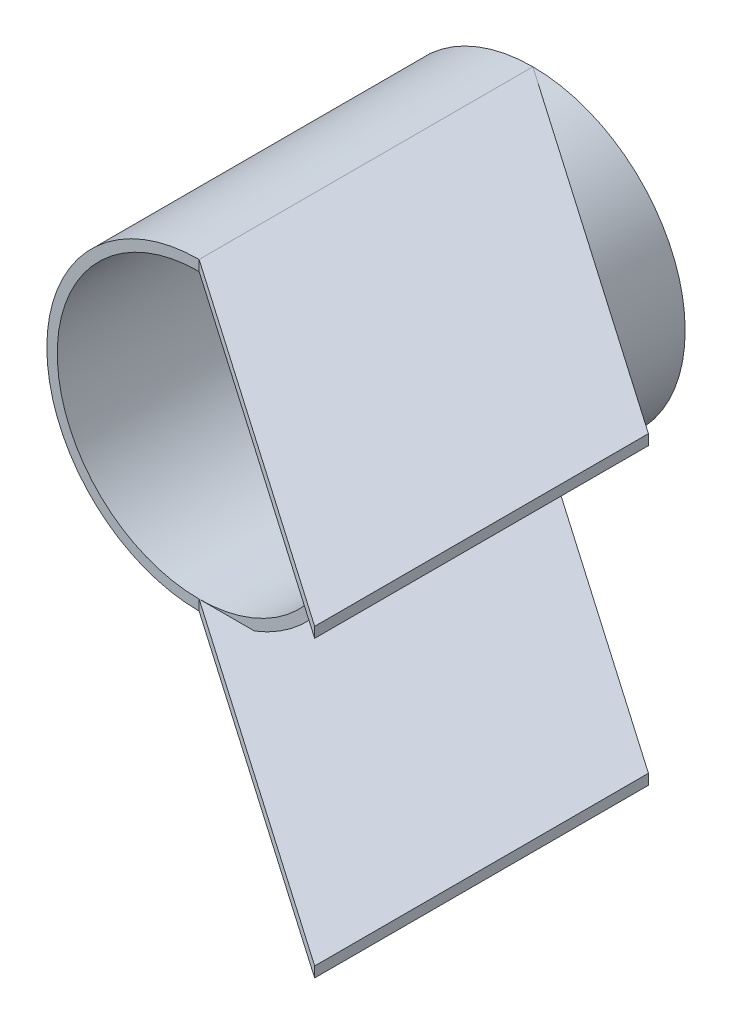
ISO-10303-21;
HEADER;
FILE_DESCRIPTION(('STEP AP214'),'2;1');
FILE_NAME('part.step','',(''),(''),'','','');
FILE_SCHEMA(('AUTOMOTIVE_DESIGN { 1 0 10303 214 1 1 1 1 }'));
ENDSEC;
DATA;
#1=APPLICATION_CONTEXT('core data for automotive mechanical design processes');
#2=APPLICATION_PROTOCOL_DEFINITION('international standard','automotive_design',2000,#1);
#3=PRODUCT_CONTEXT('',#1,'mechanical');
#4=PRODUCT('Part','Part','',(#3));
#5=PRODUCT_RELATED_PRODUCT_CATEGORY('part','',(#4));
#6=PRODUCT_DEFINITION_FORMATION('','',#4);
#7=PRODUCT_DEFINITION_CONTEXT('part definition',#1,'design');
#8=PRODUCT_DEFINITION('design','',#6,#7);
#9=PRODUCT_DEFINITION_SHAPE('','',#8);
#10=(LENGTH_UNIT() NAMED_UNIT(*) SI_UNIT(.MILLI.,.METRE.));
#11=(NAMED_UNIT(*) PLANE_ANGLE_UNIT() SI_UNIT($,.RADIAN.));
#12=(NAMED_UNIT(*) SI_UNIT($,.STERADIAN.) SOLID_ANGLE_UNIT());
#13=UNCERTAINTY_MEASURE_WITH_UNIT(LENGTH_MEASURE(1.E-05),#10,'distance_accuracy_value','');
#14=(GEOMETRIC_REPRESENTATION_CONTEXT(3) GLOBAL_UNCERTAINTY_ASSIGNED_CONTEXT((#13)) GLOBAL_UNIT_ASSIGNED_CONTEXT((#10,
#11,#12)) REPRESENTATION_CONTEXT('',''));
#15=CARTESIAN_POINT('',(0.,0.,0.));
#16=DIRECTION('',(0.,0.,1.));
#17=DIRECTION('',(1.,0.,0.));
#18=AXIS2_PLACEMENT_3D('',#15,#16,#17);
#19=CARTESIAN_POINT('',(0.,-46.355,0.));
#20=DIRECTION('',(0.569209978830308,0.,-0.822192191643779));
#21=DIRECTION('',(-0.822192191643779,0.,-0.569209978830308));
#22=AXIS2_PLACEMENT_3D('',#19,#20,#21);
#23=PLANE('',#22);
#24=DIRECTION('',(0.,1.,0.));
#25=VECTOR('',#24,1.);
#26=CARTESIAN_POINT('',(114.3,-46.355,79.1307692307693));
#27=LINE('',#26,#25);
#28=CARTESIAN_POINT('',(114.3,-46.355,79.1307692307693));
#29=VERTEX_POINT('',#28);
#30=CARTESIAN_POINT('',(114.3,-43.18,79.1307692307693));
#31=VERTEX_POINT('',#30);
#32=EDGE_CURVE('E48',#29,#31,#27,.T.);
#33=ORIENTED_EDGE('',*,*,#32,.F.);
#34=DIRECTION('',(-0.822192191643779,0.,-0.569209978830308));
#35=VECTOR('',#34,1.);
#36=CARTESIAN_POINT('',(0.,-46.355,0.));
#37=LINE('',#36,#35);
#38=CARTESIAN_POINT('',(0.,-46.355,0.));
#39=VERTEX_POINT('',#38);
#40=EDGE_CURVE('E215',#29,#39,#37,.T.);
#41=ORIENTED_EDGE('',*,*,#40,.T.);
#42=CARTESIAN_POINT('',(0.,0.,0.));
#43=DIRECTION('',(0.569209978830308,0.,-0.822192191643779));
#44=DIRECTION('',(-0.822192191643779,0.,-0.569209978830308));
#45=AXIS2_PLACEMENT_3D('',#42,#43,#44);
#46=ELLIPSE('',#45,56.3797618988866,46.355);
#47=CARTESIAN_POINT('',(16.8604159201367,-43.18,11.6725956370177));
#48=VERTEX_POINT('',#47);
#49=EDGE_CURVE('E123',#48,#39,#46,.T.);
#50=ORIENTED_EDGE('',*,*,#49,.F.);
#51=DIRECTION('',(-0.822192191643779,0.,-0.569209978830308));
#52=VECTOR('',#51,1.);
#53=CARTESIAN_POINT('',(0.,-43.18,0.));
#54=LINE('',#53,#52);
#55=EDGE_CURVE('E214',#31,#48,#54,.T.);
#56=ORIENTED_EDGE('',*,*,#55,.F.);
#57=EDGE_LOOP('',(#33,#41,#50,#56));
#58=FACE_BOUND('',#57,.T.);
#59=ADVANCED_FACE('F33',(#58),#23,.T.);
#60=CARTESIAN_POINT('',(0.,-46.355,101.6));
#61=DIRECTION('',(-0.569209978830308,0.,0.822192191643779));
#62=DIRECTION('',(0.822192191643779,0.,0.569209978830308));
#63=AXIS2_PLACEMENT_3D('',#60,#61,#62);
#64=PLANE('',#63);
#65=DIRECTION('',(0.,-1.,0.));
#66=VECTOR('',#65,1.);
#67=CARTESIAN_POINT('',(114.3,-46.355,180.730769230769));
#68=LINE('',#67,#66);
#69=CARTESIAN_POINT('',(114.3,-43.18,180.730769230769));
#70=VERTEX_POINT('',#69);
#71=CARTESIAN_POINT('',(114.3,-46.355,180.730769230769));
#72=VERTEX_POINT('',#71);
#73=EDGE_CURVE('E205',#70,#72,#68,.T.);
#74=ORIENTED_EDGE('',*,*,#73,.F.);
#75=DIRECTION('',(0.822192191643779,0.,0.569209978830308));
#76=VECTOR('',#75,1.);
#77=CARTESIAN_POINT('',(0.,-43.18,101.6));
#78=LINE('',#77,#76);
#79=CARTESIAN_POINT('',(0.,-43.18,101.6));
#80=VERTEX_POINT('',#79);
#81=EDGE_CURVE('E218',#80,#70,#78,.T.);
#82=ORIENTED_EDGE('',*,*,#81,.F.);
#83=DIRECTION('',(0.,1.,0.));
#84=VECTOR('',#83,1.);
#85=CARTESIAN_POINT('',(0.,-46.355,101.6));
#86=LINE('',#85,#84);
#87=CARTESIAN_POINT('',(0.,-46.355,101.6));
#88=VERTEX_POINT('',#87);
#89=EDGE_CURVE('E185',#88,#80,#86,.T.);
#90=ORIENTED_EDGE('',*,*,#89,.F.);
#91=DIRECTION('',(0.822192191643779,0.,0.569209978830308));
#92=VECTOR('',#91,1.);
#93=CARTESIAN_POINT('',(0.,-46.355,101.6));
#94=LINE('',#93,#92);
#95=EDGE_CURVE('E217',#88,#72,#94,.T.);
#96=ORIENTED_EDGE('',*,*,#95,.T.);
#97=EDGE_LOOP('',(#74,#82,#90,#96));
#98=FACE_BOUND('',#97,.T.);
#99=ADVANCED_FACE('F225',(#98),#64,.T.);
#100=CARTESIAN_POINT('',(0.,-46.355,0.));
#101=DIRECTION('',(0.,1.,0.));
#102=DIRECTION('',(0.,0.,-1.));
#103=AXIS2_PLACEMENT_3D('',#100,#101,#102);
#104=PLANE('',#103);
#105=ORIENTED_EDGE('',*,*,#40,.F.);
#106=DIRECTION('',(0.,0.,1.));
#107=VECTOR('',#106,1.);
#108=CARTESIAN_POINT('',(114.3,-46.355,0.));
#109=LINE('',#108,#107);
#110=EDGE_CURVE('E211',#29,#72,#109,.T.);
#111=ORIENTED_EDGE('',*,*,#110,.T.);
#112=ORIENTED_EDGE('',*,*,#95,.F.);
#113=DIRECTION('',(0.,0.,1.));
#114=VECTOR('',#113,1.);
#115=CARTESIAN_POINT('',(0.,-46.355,0.));
#116=LINE('',#115,#114);
#117=EDGE_CURVE('E191',#39,#88,#116,.T.);
#118=ORIENTED_EDGE('',*,*,#117,.F.);
#119=EDGE_LOOP('',(#105,#111,#112,#118));
#120=FACE_BOUND('',#119,.T.);
#121=ADVANCED_FACE('F229',(#120),#104,.F.);
#122=CARTESIAN_POINT('',(0.,-43.18,0.));
#123=DIRECTION('',(0.,1.,0.));
#124=DIRECTION('',(0.,0.,-1.));
#125=AXIS2_PLACEMENT_3D('',#122,#123,#124);
#126=PLANE('',#125);
#127=DIRECTION('',(0.,0.,1.));
#128=VECTOR('',#127,1.);
#129=CARTESIAN_POINT('',(114.3,-43.18,0.));
#130=LINE('',#129,#128);
#131=EDGE_CURVE('E203',#31,#70,#130,.T.);
#132=ORIENTED_EDGE('',*,*,#131,.F.);
#133=ORIENTED_EDGE('',*,*,#55,.T.);
#134=DIRECTION('',(0.,0.,-1.));
#135=VECTOR('',#134,1.);
#136=CARTESIAN_POINT('',(16.8604159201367,-43.18,101.6));
#137=LINE('',#136,#135);
#138=CARTESIAN_POINT('',(16.8604159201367,-43.18,101.6));
#139=VERTEX_POINT('',#138);
#140=EDGE_CURVE('E190',#139,#48,#137,.T.);
#141=ORIENTED_EDGE('',*,*,#140,.F.);
#142=DIRECTION('',(-1.,0.,0.));
#143=VECTOR('',#142,1.);
#144=CARTESIAN_POINT('',(0.,-43.18,101.6));
#145=LINE('',#144,#143);
#146=EDGE_CURVE('E127',#139,#80,#145,.T.);
#147=ORIENTED_EDGE('',*,*,#146,.T.);
#148=ORIENTED_EDGE('',*,*,#81,.T.);
#149=EDGE_LOOP('',(#132,#133,#141,#147,#148));
#150=FACE_BOUND('',#149,.T.);
#151=ADVANCED_FACE('F222',(#150),#126,.T.);
#152=CARTESIAN_POINT('',(0.,46.355,0.));
#153=DIRECTION('',(0.,-1.,0.));
#154=DIRECTION('',(0.,0.,-1.));
#155=AXIS2_PLACEMENT_3D('',#152,#153,#154);
#156=PLANE('',#155);
#157=DIRECTION('',(0.822192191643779,0.,0.569209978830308));
#158=VECTOR('',#157,1.);
#159=CARTESIAN_POINT('',(0.,46.355,101.6));
#160=LINE('',#159,#158);
#161=CARTESIAN_POINT('',(0.,46.355,101.6));
#162=VERTEX_POINT('',#161);
#163=CARTESIAN_POINT('',(114.3,46.355,180.730769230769));
#164=VERTEX_POINT('',#163);
#165=EDGE_CURVE('E130',#162,#164,#160,.T.);
#166=ORIENTED_EDGE('',*,*,#165,.T.);
#167=DIRECTION('',(0.,0.,-1.));
#168=VECTOR('',#167,1.);
#169=CARTESIAN_POINT('',(114.3,46.355,0.));
#170=LINE('',#169,#168);
#171=CARTESIAN_POINT('',(114.3,46.355,79.1307692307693));
#172=VERTEX_POINT('',#171);
#173=EDGE_CURVE('E115',#164,#172,#170,.T.);
#174=ORIENTED_EDGE('',*,*,#173,.T.);
#175=DIRECTION('',(-0.822192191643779,0.,-0.569209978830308));
#176=VECTOR('',#175,1.);
#177=CARTESIAN_POINT('',(0.,46.355,0.));
#178=LINE('',#177,#176);
#179=CARTESIAN_POINT('',(0.,46.355,0.));
#180=VERTEX_POINT('',#179);
#181=EDGE_CURVE('E114',#172,#180,#178,.T.);
#182=ORIENTED_EDGE('',*,*,#181,.T.);
#183=DIRECTION('',(0.,0.,1.));
#184=VECTOR('',#183,1.);
#185=CARTESIAN_POINT('',(0.,46.355,0.));
#186=LINE('',#185,#184);
#187=EDGE_CURVE('E164',#180,#162,#186,.T.);
#188=ORIENTED_EDGE('',*,*,#187,.T.);
#189=EDGE_LOOP('',(#166,#174,#182,#188));
#190=FACE_BOUND('',#189,.T.);
#191=ADVANCED_FACE('F202',(#190),#156,.F.);
#192=CARTESIAN_POINT('',(0.,0.,101.6));
#193=DIRECTION('',(0.,0.,1.));
#194=DIRECTION('',(1.,0.,0.));
#195=AXIS2_PLACEMENT_3D('',#192,#193,#194);
#196=PLANE('',#195);
#197=ORIENTED_EDGE('',*,*,#89,.T.);
#198=CARTESIAN_POINT('',(0.,0.,101.6));
#199=DIRECTION('',(0.,0.,1.));
#200=DIRECTION('',(1.,0.,0.));
#201=AXIS2_PLACEMENT_3D('',#198,#199,#200);
#202=CIRCLE('',#201,43.18);
#203=CARTESIAN_POINT('',(0.,43.18,101.6));
#204=VERTEX_POINT('',#203);
#205=EDGE_CURVE('E142',#204,#80,#202,.T.);
#206=ORIENTED_EDGE('',*,*,#205,.F.);
#207=DIRECTION('',(0.,-1.,0.));
#208=VECTOR('',#207,1.);
#209=CARTESIAN_POINT('',(0.,46.355,101.6));
#210=LINE('',#209,#208);
#211=EDGE_CURVE('E133',#162,#204,#210,.T.);
#212=ORIENTED_EDGE('',*,*,#211,.F.);
#213=CARTESIAN_POINT('',(0.,0.,101.6));
#214=DIRECTION('',(0.,0.,1.));
#215=DIRECTION('',(1.,0.,0.));
#216=AXIS2_PLACEMENT_3D('',#213,#214,#215);
#217=CIRCLE('',#216,46.355);
#218=EDGE_CURVE('E41',#162,#88,#217,.T.);
#219=ORIENTED_EDGE('',*,*,#218,.T.);
#220=EDGE_LOOP('',(#197,#206,#212,#219));
#221=FACE_BOUND('',#220,.T.);
#222=ADVANCED_FACE('F184',(#221),#196,.T.);
#223=CARTESIAN_POINT('',(0.,0.,101.6));
#224=DIRECTION('',(0.,0.,-1.));
#225=DIRECTION('',(-1.,0.,0.));
#226=AXIS2_PLACEMENT_3D('',#223,#224,#225);
#227=CYLINDRICAL_SURFACE('',#226,46.355);
#228=ORIENTED_EDGE('',*,*,#117,.T.);
#229=ORIENTED_EDGE('',*,*,#218,.F.);
#230=ORIENTED_EDGE('',*,*,#187,.F.);
#231=CARTESIAN_POINT('',(0.,0.,0.));
#232=DIRECTION('',(0.,0.,1.));
#233=DIRECTION('',(1.,0.,0.));
#234=AXIS2_PLACEMENT_3D('',#231,#232,#233);
#235=CIRCLE('',#234,46.355);
#236=EDGE_CURVE('E151',#180,#39,#235,.T.);
#237=ORIENTED_EDGE('',*,*,#236,.T.);
#238=EDGE_LOOP('',(#228,#229,#230,#237));
#239=FACE_BOUND('',#238,.T.);
#240=ADVANCED_FACE('F165',(#239),#227,.T.);
#241=ORIENTED_EDGE('',*,*,#146,.F.);
#242=CARTESIAN_POINT('',(16.8604159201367,43.18,101.6));
#243=VERTEX_POINT('',#242);
#244=EDGE_CURVE('E150',#139,#243,#217,.T.);
#245=ORIENTED_EDGE('',*,*,#244,.T.);
#246=DIRECTION('',(1.,0.,0.));
#247=VECTOR('',#246,1.);
#248=CARTESIAN_POINT('',(0.,43.18,101.6));
#249=LINE('',#248,#247);
#250=EDGE_CURVE('E137',#204,#243,#249,.T.);
#251=ORIENTED_EDGE('',*,*,#250,.F.);
#252=EDGE_CURVE('E146',#80,#204,#202,.T.);
#253=ORIENTED_EDGE('',*,*,#252,.F.);
#254=EDGE_LOOP('',(#241,#245,#251,#253));
#255=FACE_BOUND('',#254,.T.);
#256=ADVANCED_FACE('F172',(#255),#196,.T.);
#257=CARTESIAN_POINT('',(0.,0.,0.));
#258=DIRECTION('',(0.,0.,1.));
#259=DIRECTION('',(1.,0.,0.));
#260=AXIS2_PLACEMENT_3D('',#257,#258,#259);
#261=PLANE('',#260);
#262=EDGE_CURVE('E145',#39,#180,#235,.T.);
#263=ORIENTED_EDGE('',*,*,#262,.F.);
#264=ORIENTED_EDGE('',*,*,#236,.F.);
#265=EDGE_LOOP('',(#263,#264));
#266=FACE_BOUND('',#265,.T.);
#267=CARTESIAN_POINT('',(0.,0.,0.));
#268=DIRECTION('',(0.,0.,1.));
#269=DIRECTION('',(1.,0.,0.));
#270=AXIS2_PLACEMENT_3D('',#267,#268,#269);
#271=CIRCLE('',#270,43.18);
#272=CARTESIAN_POINT('',(43.18,0.,0.));
#273=VERTEX_POINT('',#272);
#274=EDGE_CURVE('E141',#273,#273,#271,.T.);
#275=ORIENTED_EDGE('',*,*,#274,.T.);
#276=EDGE_LOOP('',(#275));
#277=FACE_BOUND('',#276,.T.);
#278=ADVANCED_FACE('F169',(#266,#277),#261,.F.);
#279=ORIENTED_EDGE('',*,*,#140,.T.);
#280=ORIENTED_EDGE('',*,*,#49,.T.);
#281=ORIENTED_EDGE('',*,*,#262,.T.);
#282=CARTESIAN_POINT('',(0.,0.,0.));
#283=DIRECTION('',(-0.569209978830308,0.,0.822192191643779));
#284=DIRECTION('',(-0.822192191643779,0.,-0.569209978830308));
#285=AXIS2_PLACEMENT_3D('',#282,#283,#284);
#286=ELLIPSE('',#285,56.3797618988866,46.355);
#287=CARTESIAN_POINT('',(16.8604159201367,43.18,11.6725956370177));
#288=VERTEX_POINT('',#287);
#289=EDGE_CURVE('E139',#288,#180,#286,.T.);
#290=ORIENTED_EDGE('',*,*,#289,.F.);
#291=DIRECTION('',(0.,0.,-1.));
#292=VECTOR('',#291,1.);
#293=CARTESIAN_POINT('',(16.8604159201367,43.18,101.6));
#294=LINE('',#293,#292);
#295=EDGE_CURVE('E120',#288,#243,#294,.F.);
#296=ORIENTED_EDGE('',*,*,#295,.T.);
#297=ORIENTED_EDGE('',*,*,#244,.F.);
#298=EDGE_LOOP('',(#279,#280,#281,#290,#296,#297));
#299=FACE_BOUND('',#298,.T.);
#300=ADVANCED_FACE('F35',(#299),#227,.T.);
#301=CARTESIAN_POINT('',(0.,0.,101.6));
#302=DIRECTION('',(0.,0.,-1.));
#303=DIRECTION('',(-1.,0.,0.));
#304=AXIS2_PLACEMENT_3D('',#301,#302,#303);
#305=CYLINDRICAL_SURFACE('',#304,43.18);
#306=ORIENTED_EDGE('',*,*,#274,.F.);
#307=EDGE_LOOP('',(#306));
#308=FACE_BOUND('',#307,.T.);
#309=ORIENTED_EDGE('',*,*,#205,.T.);
#310=ORIENTED_EDGE('',*,*,#252,.T.);
#311=EDGE_LOOP('',(#309,#310));
#312=FACE_BOUND('',#311,.T.);
#313=ADVANCED_FACE('F175',(#308,#312),#305,.F.);
#314=CARTESIAN_POINT('',(0.,46.355,0.));
#315=DIRECTION('',(-0.569209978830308,0.,0.822192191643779));
#316=DIRECTION('',(0.822192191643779,0.,0.569209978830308));
#317=AXIS2_PLACEMENT_3D('',#314,#315,#316);
#318=PLANE('',#317);
#319=ORIENTED_EDGE('',*,*,#181,.F.);
#320=DIRECTION('',(0.,-1.,0.));
#321=VECTOR('',#320,1.);
#322=CARTESIAN_POINT('',(114.3,46.355,79.1307692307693));
#323=LINE('',#322,#321);
#324=CARTESIAN_POINT('',(114.3,43.18,79.1307692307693));
#325=VERTEX_POINT('',#324);
#326=EDGE_CURVE('E102',#172,#325,#323,.T.);
#327=ORIENTED_EDGE('',*,*,#326,.T.);
#328=DIRECTION('',(-0.822192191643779,0.,-0.569209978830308));
#329=VECTOR('',#328,1.);
#330=CARTESIAN_POINT('',(0.,43.18,0.));
#331=LINE('',#330,#329);
#332=EDGE_CURVE('E112',#325,#288,#331,.T.);
#333=ORIENTED_EDGE('',*,*,#332,.T.);
#334=ORIENTED_EDGE('',*,*,#289,.T.);
#335=EDGE_LOOP('',(#319,#327,#333,#334));
#336=FACE_BOUND('',#335,.T.);
#337=ADVANCED_FACE('F110',(#336),#318,.F.);
#338=CARTESIAN_POINT('',(0.,46.355,101.6));
#339=DIRECTION('',(0.569209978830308,0.,-0.822192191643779));
#340=DIRECTION('',(-0.822192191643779,0.,-0.569209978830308));
#341=AXIS2_PLACEMENT_3D('',#338,#339,#340);
#342=PLANE('',#341);
#343=DIRECTION('',(0.822192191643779,0.,0.569209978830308));
#344=VECTOR('',#343,1.);
#345=CARTESIAN_POINT('',(0.,43.18,101.6));
#346=LINE('',#345,#344);
#347=CARTESIAN_POINT('',(114.3,43.18,180.730769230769));
#348=VERTEX_POINT('',#347);
#349=EDGE_CURVE('E122',#204,#348,#346,.T.);
#350=ORIENTED_EDGE('',*,*,#349,.T.);
#351=DIRECTION('',(0.,1.,0.));
#352=VECTOR('',#351,1.);
#353=CARTESIAN_POINT('',(114.3,46.355,180.730769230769));
#354=LINE('',#353,#352);
#355=EDGE_CURVE('E55',#348,#164,#354,.T.);
#356=ORIENTED_EDGE('',*,*,#355,.T.);
#357=ORIENTED_EDGE('',*,*,#165,.F.);
#358=ORIENTED_EDGE('',*,*,#211,.T.);
#359=EDGE_LOOP('',(#350,#356,#357,#358));
#360=FACE_BOUND('',#359,.T.);
#361=ADVANCED_FACE('F244',(#360),#342,.F.);
#362=CARTESIAN_POINT('',(0.,43.18,0.));
#363=DIRECTION('',(0.,-1.,0.));
#364=DIRECTION('',(0.,0.,-1.));
#365=AXIS2_PLACEMENT_3D('',#362,#363,#364);
#366=PLANE('',#365);
#367=DIRECTION('',(0.,0.,-1.));
#368=VECTOR('',#367,1.);
#369=CARTESIAN_POINT('',(114.3,43.18,0.));
#370=LINE('',#369,#368);
#371=EDGE_CURVE('E11',#348,#325,#370,.T.);
#372=ORIENTED_EDGE('',*,*,#371,.F.);
#373=ORIENTED_EDGE('',*,*,#349,.F.);
#374=ORIENTED_EDGE('',*,*,#250,.T.);
#375=ORIENTED_EDGE('',*,*,#295,.F.);
#376=ORIENTED_EDGE('',*,*,#332,.F.);
#377=EDGE_LOOP('',(#372,#373,#374,#375,#376));
#378=FACE_BOUND('',#377,.T.);
#379=ADVANCED_FACE('F117',(#378),#366,.T.);
#380=CARTESIAN_POINT('',(114.3,-84.455,225.449104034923));
#381=DIRECTION('',(-1.,0.,0.));
#382=DIRECTION('',(0.,0.,1.));
#383=AXIS2_PLACEMENT_3D('',#380,#381,#382);
#384=PLANE('',#383);
#385=ORIENTED_EDGE('',*,*,#355,.F.);
#386=ORIENTED_EDGE('',*,*,#371,.T.);
#387=ORIENTED_EDGE('',*,*,#326,.F.);
#388=ORIENTED_EDGE('',*,*,#173,.F.);
#389=EDGE_LOOP('',(#385,#386,#387,#388));
#390=FACE_BOUND('',#389,.T.);
#391=ADVANCED_FACE('F101',(#390),#384,.F.);
#392=ORIENTED_EDGE('',*,*,#32,.T.);
#393=ORIENTED_EDGE('',*,*,#131,.T.);
#394=ORIENTED_EDGE('',*,*,#73,.T.);
#395=ORIENTED_EDGE('',*,*,#110,.F.);
#396=EDGE_LOOP('',(#392,#393,#394,#395));
#397=FACE_BOUND('',#396,.T.);
#398=ADVANCED_FACE('F226',(#397),#384,.F.);
#399=CLOSED_SHELL('',(#59,#99,#121,#151,#191,#222,#240,#256,#278,#300,#313,#337,#361,#379,#391,#398));
#400=MANIFOLD_SOLID_BREP('B2',#399);
#401=ADVANCED_BREP_SHAPE_REPRESENTATION('',(#18,#400),#14);
#402=SHAPE_DEFINITION_REPRESENTATION(#9,#401);
ENDSEC;
END-ISO-10303-21;
